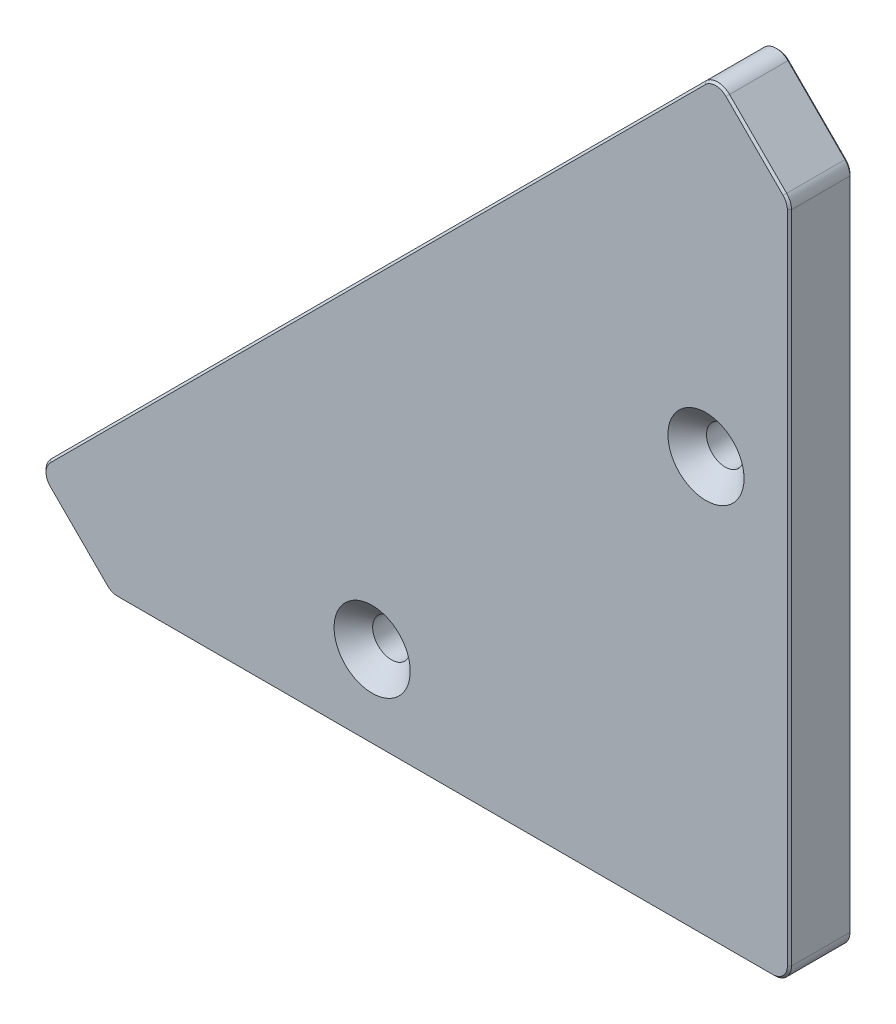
from build123d import *

# Parameters (mm, degrees)
AUFSATZ_LINEAR_AUSTRAGEN1_DEPTH                      = 15
SCHNITT_LINEAR_AUSTRAGEN2_DEPTH                      = 281.401497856
VERRUNDUNG1_R                                        = 4
FORMSENKUNG_F_R_M8_SENKSCHRAUBE_MIT_INNE_D           = 9
FORMSENKUNG_F_R_M8_SENKSCHRAUBE_MIT_INNE_CSINK_D     = 18.25
FORMSENKUNG_F_R_M8_SENKSCHRAUBE_MIT_INNE_CSINK_ANGLE = 90
FASE1_SIZE                                           = 0.5


with BuildPart() as part:
    # Skizze1 → Aufsatz-Linear austragen1 (new body)
    with BuildSketch(Plane.XY):
        Polygon((0, 0), (-197.989898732, 0), (0, 197.989898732), align=None)
    extrude(amount=AUFSATZ_LINEAR_AUSTRAGEN1_DEPTH)

    # Skizze4 → Schnitt-Linear austragen2 (cut, through all)
    with BuildSketch(Plane(origin=(0, 0, 0), x_dir=(-1, 0, 0), z_dir=(0, 0, -1))):
        Polygon((0, 162.634559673), (17.67766953, 180.312229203), (0, 197.989898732), align=None)
        Polygon((162.634559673, 0), (180.312229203, 17.67766953), (197.989898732, 0), align=None)
    extrude(amount=-SCHNITT_LINEAR_AUSTRAGEN2_DEPTH, mode=Mode.SUBTRACT)

    # Verrundung1
    verrundung1_edges = [part.edges().sort_by_distance(p)[0] for p in [
        (0, 162.634559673, 7.5),
        (-17.67766953, 180.312229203, 7.5),
        (-162.634559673, 0, 7.5),
        (-180.312229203, 17.67766953, 7.5),
        (0, 0, 7.5),
    ]]
    fillet(verrundung1_edges, radius=VERRUNDUNG1_R)

    # Formsenkung f_r M8 Senkschraube mit Inne (through all)
    with Locations(Plane.XY.offset(15)):
        with Locations((-100, 20), (-20, 100)):
            CounterSinkHole(FORMSENKUNG_F_R_M8_SENKSCHRAUBE_MIT_INNE_D / 2, FORMSENKUNG_F_R_M8_SENKSCHRAUBE_MIT_INNE_CSINK_D / 2, counter_sink_angle=FORMSENKUNG_F_R_M8_SENKSCHRAUBE_MIT_INNE_CSINK_ANGLE)

    # Fase1
    fase1_edges = [part.edges().sort_by_distance(p)[0] for p in [
        (-8.01040764, 170.644967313, 0),
        (-8.01040764, 170.644967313, 15),
        (0, 82.488852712, 0),
        (-82.488852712, 0, 0),
        (-170.644967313, 8.01040764, 0),
        (-98.994949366, 98.994949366, 0),
        (-1.171572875, 1.171572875, 0),
        (-162.508439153, 0.30448187, 0),
        (-178.655374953, 17.67766953, 0),
        (-17.67766953, 178.655374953, 0),
        (-0.30448187, 162.508439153, 0),
        (0, 82.488852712, 15),
        (-98.994949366, 98.994949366, 15),
        (-170.644967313, 8.01040764, 15),
        (-82.488852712, 0, 15),
        (-1.171572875, 1.171572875, 15),
        (-162.508439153, 0.30448187, 15),
        (-178.655374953, 17.67766953, 15),
        (-17.67766953, 178.655374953, 15),
        (-0.30448187, 162.508439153, 15),
    ]]
    chamfer(fase1_edges, length=FASE1_SIZE)


solid = part.part
